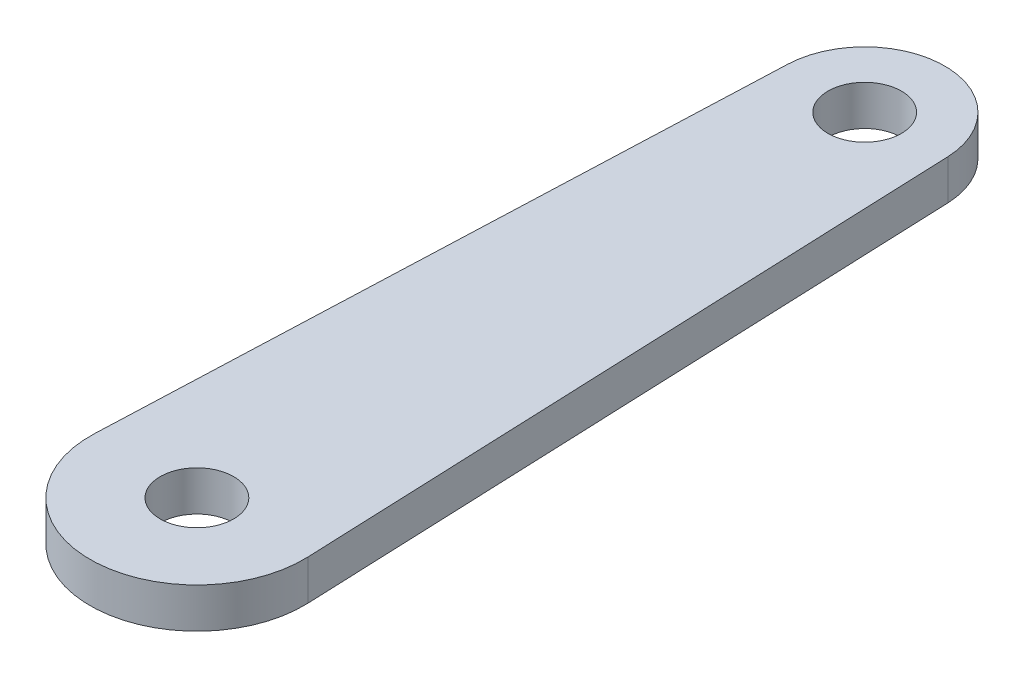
from build123d import *

# Parameters (mm, degrees)
SKETCH1_R      = 2.75
EXTRUDE1_DEPTH = 3


with BuildPart() as part:
    # Sketch1 → Extrude1 (new body)
    with BuildSketch(Plane(origin=(0, 0, 0), x_dir=(1, 0, 0), z_dir=(0, 1, 0))):
        with BuildLine():
            Line((5.995198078, 50.24), (7.993597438, 0.32))
            ThreePointArc((7.993597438, 0.32), (0, -8), (-7.993597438, 0.32))
            Line((-7.993597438, 0.32), (-5.995198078, 50.24))
            ThreePointArc((-5.995198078, 50.24), (0, 56), (5.995198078, 50.24))
        make_face()
        with Locations(Location((0, 50, 0), (0, 0, 270))):
            Circle(SKETCH1_R, mode=Mode.SUBTRACT)
        with Locations(Location((0, 0, 0), (0, 0, 270))):
            Circle(SKETCH1_R, mode=Mode.SUBTRACT)
    extrude(amount=EXTRUDE1_DEPTH)


solid = part.part
